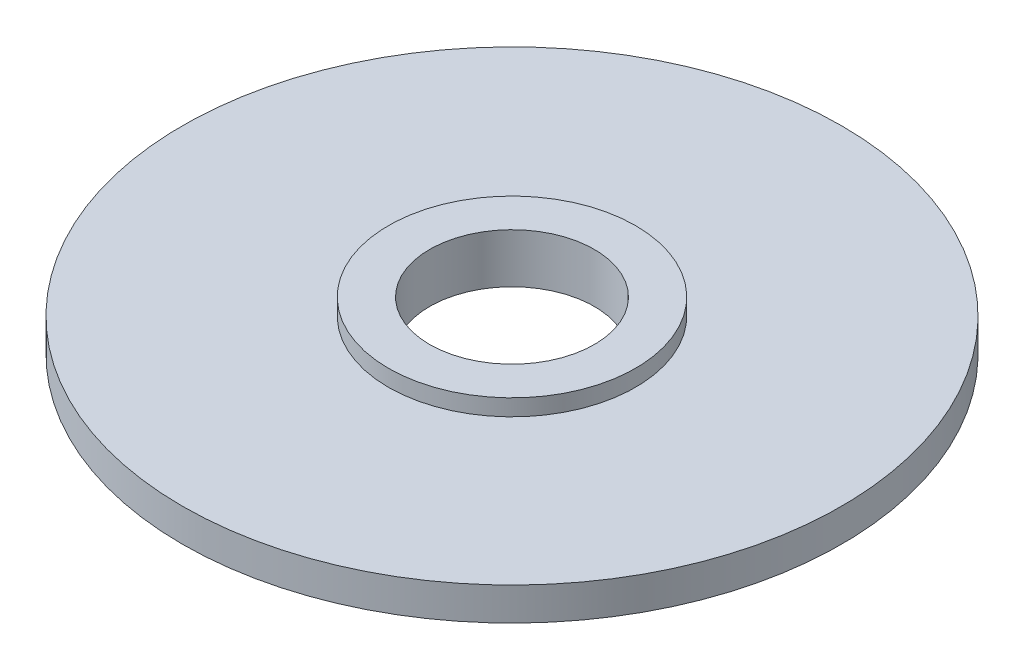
ISO-10303-21;
HEADER;
FILE_DESCRIPTION(('STEP AP214'),'2;1');
FILE_NAME('part.step','',(''),(''),'','','');
FILE_SCHEMA(('AUTOMOTIVE_DESIGN { 1 0 10303 214 1 1 1 1 }'));
ENDSEC;
DATA;
#1=APPLICATION_CONTEXT('core data for automotive mechanical design processes');
#2=APPLICATION_PROTOCOL_DEFINITION('international standard','automotive_design',2000,#1);
#3=PRODUCT_CONTEXT('',#1,'mechanical');
#4=PRODUCT('Part','Part','',(#3));
#5=PRODUCT_RELATED_PRODUCT_CATEGORY('part','',(#4));
#6=PRODUCT_DEFINITION_FORMATION('','',#4);
#7=PRODUCT_DEFINITION_CONTEXT('part definition',#1,'design');
#8=PRODUCT_DEFINITION('design','',#6,#7);
#9=PRODUCT_DEFINITION_SHAPE('','',#8);
#10=(LENGTH_UNIT() NAMED_UNIT(*) SI_UNIT(.MILLI.,.METRE.));
#11=(NAMED_UNIT(*) PLANE_ANGLE_UNIT() SI_UNIT($,.RADIAN.));
#12=(NAMED_UNIT(*) SI_UNIT($,.STERADIAN.) SOLID_ANGLE_UNIT());
#13=UNCERTAINTY_MEASURE_WITH_UNIT(LENGTH_MEASURE(1.E-05),#10,'distance_accuracy_value','');
#14=(GEOMETRIC_REPRESENTATION_CONTEXT(3) GLOBAL_UNCERTAINTY_ASSIGNED_CONTEXT((#13)) GLOBAL_UNIT_ASSIGNED_CONTEXT((#10,
#11,#12)) REPRESENTATION_CONTEXT('',''));
#15=CARTESIAN_POINT('',(0.,0.,0.));
#16=DIRECTION('',(0.,0.,1.));
#17=DIRECTION('',(1.,0.,0.));
#18=AXIS2_PLACEMENT_3D('',#15,#16,#17);
#19=CARTESIAN_POINT('',(0.,2.,0.));
#20=DIRECTION('',(0.,-1.,0.));
#21=DIRECTION('',(0.,0.,-1.));
#22=AXIS2_PLACEMENT_3D('',#19,#20,#21);
#23=CYLINDRICAL_SURFACE('',#22,20.);
#24=CARTESIAN_POINT('',(0.,2.,0.));
#25=DIRECTION('',(0.,1.,0.));
#26=DIRECTION('',(0.,0.,1.));
#27=AXIS2_PLACEMENT_3D('',#24,#25,#26);
#28=CIRCLE('',#27,20.);
#29=CARTESIAN_POINT('',(0.,2.,20.));
#30=VERTEX_POINT('',#29);
#31=EDGE_CURVE('E10',#30,#30,#28,.T.);
#32=ORIENTED_EDGE('',*,*,#31,.F.);
#33=EDGE_LOOP('',(#32));
#34=FACE_BOUND('',#33,.T.);
#35=CARTESIAN_POINT('',(0.,0.,0.));
#36=DIRECTION('',(0.,1.,0.));
#37=DIRECTION('',(0.,0.,1.));
#38=AXIS2_PLACEMENT_3D('',#35,#36,#37);
#39=CIRCLE('',#38,20.);
#40=CARTESIAN_POINT('',(0.,0.,20.));
#41=VERTEX_POINT('',#40);
#42=EDGE_CURVE('E36',#41,#41,#39,.T.);
#43=ORIENTED_EDGE('',*,*,#42,.T.);
#44=EDGE_LOOP('',(#43));
#45=FACE_BOUND('',#44,.T.);
#46=ADVANCED_FACE('F33',(#34,#45),#23,.T.);
#47=CARTESIAN_POINT('',(0.,2.,0.));
#48=DIRECTION('',(0.,1.,0.));
#49=DIRECTION('',(0.,0.,1.));
#50=AXIS2_PLACEMENT_3D('',#47,#48,#49);
#51=PLANE('',#50);
#52=CARTESIAN_POINT('',(0.,2.,0.));
#53=DIRECTION('',(0.,1.,0.));
#54=DIRECTION('',(0.,0.,1.));
#55=AXIS2_PLACEMENT_3D('',#52,#53,#54);
#56=CIRCLE('',#55,7.5);
#57=CARTESIAN_POINT('',(0.,2.,7.5));
#58=VERTEX_POINT('',#57);
#59=EDGE_CURVE('E40',#58,#58,#56,.T.);
#60=ORIENTED_EDGE('',*,*,#59,.F.);
#61=EDGE_LOOP('',(#60));
#62=FACE_BOUND('',#61,.T.);
#63=ORIENTED_EDGE('',*,*,#31,.T.);
#64=EDGE_LOOP('',(#63));
#65=FACE_BOUND('',#64,.T.);
#66=ADVANCED_FACE('F75',(#62,#65),#51,.T.);
#67=CARTESIAN_POINT('',(0.,0.,0.));
#68=DIRECTION('',(0.,1.,0.));
#69=DIRECTION('',(0.,0.,1.));
#70=AXIS2_PLACEMENT_3D('',#67,#68,#69);
#71=PLANE('',#70);
#72=ORIENTED_EDGE('',*,*,#42,.F.);
#73=EDGE_LOOP('',(#72));
#74=FACE_BOUND('',#73,.T.);
#75=CARTESIAN_POINT('',(0.,0.,0.));
#76=DIRECTION('',(0.,1.,0.));
#77=DIRECTION('',(0.,0.,1.));
#78=AXIS2_PLACEMENT_3D('',#75,#76,#77);
#79=CIRCLE('',#78,5.);
#80=CARTESIAN_POINT('',(0.,0.,5.));
#81=VERTEX_POINT('',#80);
#82=EDGE_CURVE('E46',#81,#81,#79,.T.);
#83=ORIENTED_EDGE('',*,*,#82,.T.);
#84=EDGE_LOOP('',(#83));
#85=FACE_BOUND('',#84,.T.);
#86=ADVANCED_FACE('F72',(#74,#85),#71,.F.);
#87=CARTESIAN_POINT('',(0.,3.,0.));
#88=DIRECTION('',(0.,-1.,0.));
#89=DIRECTION('',(0.,0.,-1.));
#90=AXIS2_PLACEMENT_3D('',#87,#88,#89);
#91=CYLINDRICAL_SURFACE('',#90,5.);
#92=CARTESIAN_POINT('',(0.,3.,0.));
#93=DIRECTION('',(0.,1.,0.));
#94=DIRECTION('',(0.,0.,1.));
#95=AXIS2_PLACEMENT_3D('',#92,#93,#94);
#96=CIRCLE('',#95,5.);
#97=CARTESIAN_POINT('',(0.,3.,5.));
#98=VERTEX_POINT('',#97);
#99=EDGE_CURVE('E49',#98,#98,#96,.T.);
#100=ORIENTED_EDGE('',*,*,#99,.T.);
#101=EDGE_LOOP('',(#100));
#102=FACE_BOUND('',#101,.T.);
#103=ORIENTED_EDGE('',*,*,#82,.F.);
#104=EDGE_LOOP('',(#103));
#105=FACE_BOUND('',#104,.T.);
#106=ADVANCED_FACE('F56',(#102,#105),#91,.F.);
#107=CARTESIAN_POINT('',(0.,3.,0.));
#108=DIRECTION('',(0.,-1.,0.));
#109=DIRECTION('',(0.,0.,-1.));
#110=AXIS2_PLACEMENT_3D('',#107,#108,#109);
#111=CYLINDRICAL_SURFACE('',#110,7.5);
#112=ORIENTED_EDGE('',*,*,#59,.T.);
#113=EDGE_LOOP('',(#112));
#114=FACE_BOUND('',#113,.T.);
#115=CARTESIAN_POINT('',(0.,3.,0.));
#116=DIRECTION('',(0.,1.,0.));
#117=DIRECTION('',(0.,0.,1.));
#118=AXIS2_PLACEMENT_3D('',#115,#116,#117);
#119=CIRCLE('',#118,7.5);
#120=CARTESIAN_POINT('',(0.,3.,7.5));
#121=VERTEX_POINT('',#120);
#122=EDGE_CURVE('E50',#121,#121,#119,.T.);
#123=ORIENTED_EDGE('',*,*,#122,.F.);
#124=EDGE_LOOP('',(#123));
#125=FACE_BOUND('',#124,.T.);
#126=ADVANCED_FACE('F62',(#114,#125),#111,.T.);
#127=CARTESIAN_POINT('',(0.,3.,0.));
#128=DIRECTION('',(0.,1.,0.));
#129=DIRECTION('',(0.,0.,1.));
#130=AXIS2_PLACEMENT_3D('',#127,#128,#129);
#131=PLANE('',#130);
#132=ORIENTED_EDGE('',*,*,#99,.F.);
#133=EDGE_LOOP('',(#132));
#134=FACE_BOUND('',#133,.T.);
#135=ORIENTED_EDGE('',*,*,#122,.T.);
#136=EDGE_LOOP('',(#135));
#137=FACE_BOUND('',#136,.T.);
#138=ADVANCED_FACE('F59',(#134,#137),#131,.T.);
#139=CLOSED_SHELL('',(#46,#66,#86,#106,#126,#138));
#140=MANIFOLD_SOLID_BREP('B2',#139);
#141=ADVANCED_BREP_SHAPE_REPRESENTATION('',(#18,#140),#14);
#142=SHAPE_DEFINITION_REPRESENTATION(#9,#141);
ENDSEC;
END-ISO-10303-21;
